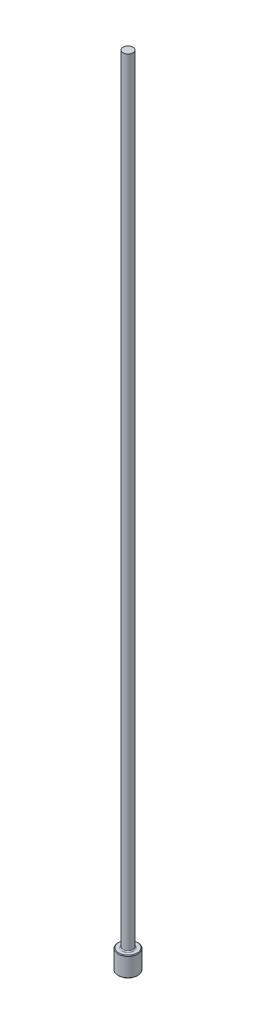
from build123d import *

# Parameters (mm, degrees)
CHAMFER1_SIZE = 0.0508
FILLET1_R     = 0.0762


with BuildPart() as part:
    # Sketch1 → Revolve1 (revolve)
    with BuildSketch(Plane.XY, mode=Mode.PRIVATE) as revolve1_sk:
        Polygon((0, 0), (-0.7874, 0), (-0.7874, 1.5748), (-0.3937, 1.5748), (-0.3937, 63.5), (0, 63.5), align=None)
    revolve(revolve1_sk.sketch.rotate(Axis((0, 259.958771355, 0), (0, -1, 0)), 270), axis=Axis((0, 259.958771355, 0), (0, -1, 0)))

    # Chamfer1
    chamfer1_edges = [part.edges().sort_by_distance(p)[0] for p in [
        (0, 1.5748, -0.7874),
        (0, 0, -0.7874),
    ]]
    chamfer(chamfer1_edges, length=CHAMFER1_SIZE)

    # Fillet1
    fillet1_edges = [part.edges().sort_by_distance(p)[0] for p in [
        (0, 1.5748, -0.3937),
    ]]
    fillet(fillet1_edges, radius=FILLET1_R)


solid = part.part
